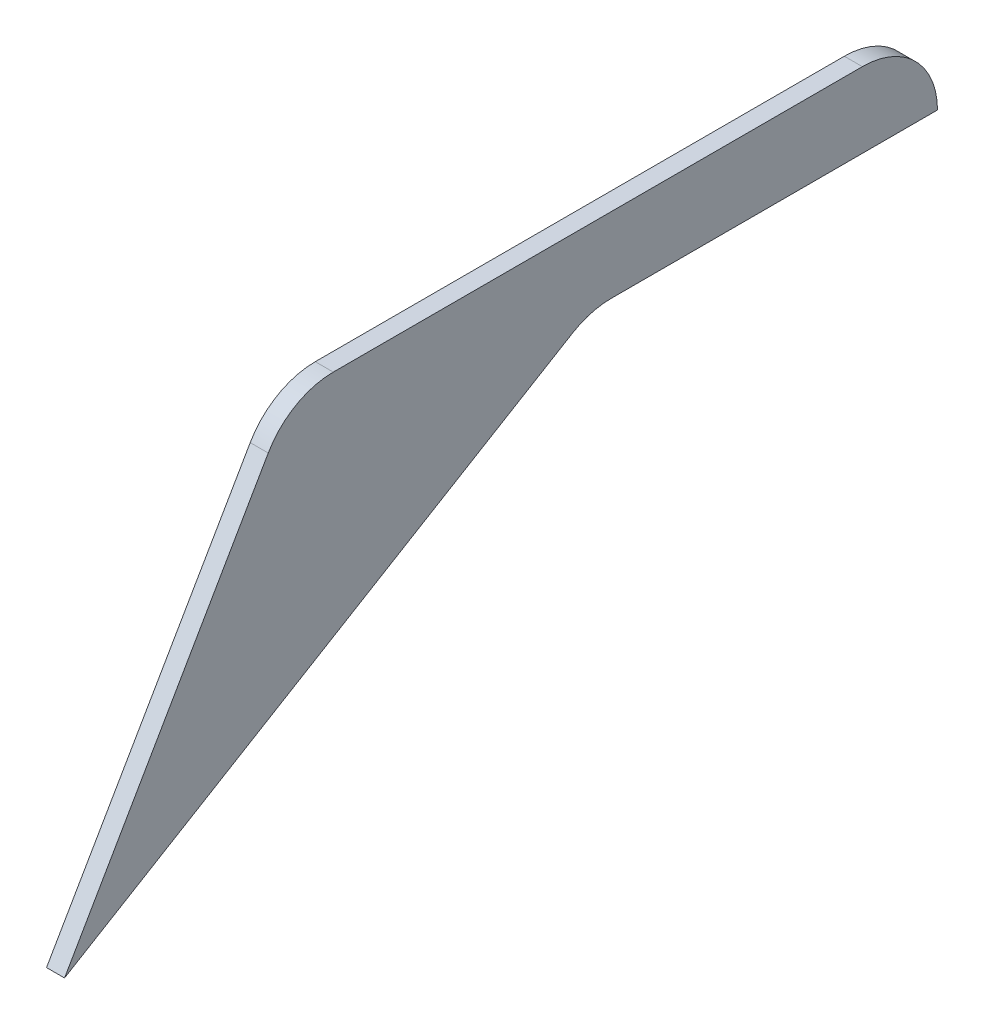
ISO-10303-21;
HEADER;
FILE_DESCRIPTION(('STEP AP214'),'2;1');
FILE_NAME('part.step','',(''),(''),'','','');
FILE_SCHEMA(('AUTOMOTIVE_DESIGN { 1 0 10303 214 1 1 1 1 }'));
ENDSEC;
DATA;
#1=APPLICATION_CONTEXT('core data for automotive mechanical design processes');
#2=APPLICATION_PROTOCOL_DEFINITION('international standard','automotive_design',2000,#1);
#3=PRODUCT_CONTEXT('',#1,'mechanical');
#4=PRODUCT('Part','Part','',(#3));
#5=PRODUCT_RELATED_PRODUCT_CATEGORY('part','',(#4));
#6=PRODUCT_DEFINITION_FORMATION('','',#4);
#7=PRODUCT_DEFINITION_CONTEXT('part definition',#1,'design');
#8=PRODUCT_DEFINITION('design','',#6,#7);
#9=PRODUCT_DEFINITION_SHAPE('','',#8);
#10=(LENGTH_UNIT() NAMED_UNIT(*) SI_UNIT(.MILLI.,.METRE.));
#11=(NAMED_UNIT(*) PLANE_ANGLE_UNIT() SI_UNIT($,.RADIAN.));
#12=(NAMED_UNIT(*) SI_UNIT($,.STERADIAN.) SOLID_ANGLE_UNIT());
#13=UNCERTAINTY_MEASURE_WITH_UNIT(LENGTH_MEASURE(1.E-05),#10,'distance_accuracy_value','');
#14=(GEOMETRIC_REPRESENTATION_CONTEXT(3) GLOBAL_UNCERTAINTY_ASSIGNED_CONTEXT((#13)) GLOBAL_UNIT_ASSIGNED_CONTEXT((#10,
#11,#12)) REPRESENTATION_CONTEXT('',''));
#15=CARTESIAN_POINT('',(0.,0.,0.));
#16=DIRECTION('',(0.,0.,1.));
#17=DIRECTION('',(1.,0.,0.));
#18=AXIS2_PLACEMENT_3D('',#15,#16,#17);
#19=CARTESIAN_POINT('',(343.116830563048,208.8847469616,-451.797499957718));
#20=DIRECTION('',(-1.,0.,0.));
#21=DIRECTION('',(0.,0.,1.));
#22=AXIS2_PLACEMENT_3D('',#19,#20,#21);
#23=CYLINDRICAL_SURFACE('',#22,12.7);
#24=CARTESIAN_POINT('',(340.068830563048,208.8847469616,-451.797499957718));
#25=DIRECTION('',(1.,0.,0.));
#26=DIRECTION('',(0.,0.,-1.));
#27=AXIS2_PLACEMENT_3D('',#24,#25,#26);
#28=CIRCLE('',#27,12.7);
#29=CARTESIAN_POINT('',(340.068830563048,208.8847469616,-464.497499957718));
#30=VERTEX_POINT('',#29);
#31=CARTESIAN_POINT('',(340.068830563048,221.5847469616,-451.797499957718));
#32=VERTEX_POINT('',#31);
#33=EDGE_CURVE('E117',#30,#32,#28,.T.);
#34=ORIENTED_EDGE('',*,*,#33,.T.);
#35=DIRECTION('',(-1.,0.,0.));
#36=VECTOR('',#35,1.);
#37=CARTESIAN_POINT('',(343.116830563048,221.5847469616,-451.797499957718));
#38=LINE('',#37,#36);
#39=CARTESIAN_POINT('',(343.116830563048,221.5847469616,-451.797499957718));
#40=VERTEX_POINT('',#39);
#41=EDGE_CURVE('E98',#40,#32,#38,.T.);
#42=ORIENTED_EDGE('',*,*,#41,.F.);
#43=CARTESIAN_POINT('',(343.116830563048,208.8847469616,-451.797499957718));
#44=DIRECTION('',(1.,0.,0.));
#45=DIRECTION('',(0.,0.,-1.));
#46=AXIS2_PLACEMENT_3D('',#43,#44,#45);
#47=CIRCLE('',#46,12.7);
#48=CARTESIAN_POINT('',(343.116830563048,208.8847469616,-464.497499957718));
#49=VERTEX_POINT('',#48);
#50=EDGE_CURVE('E105',#49,#40,#47,.T.);
#51=ORIENTED_EDGE('',*,*,#50,.F.);
#52=DIRECTION('',(-1.,0.,0.));
#53=VECTOR('',#52,1.);
#54=CARTESIAN_POINT('',(343.116830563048,208.8847469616,-464.497499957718));
#55=LINE('',#54,#53);
#56=EDGE_CURVE('E131',#49,#30,#55,.T.);
#57=ORIENTED_EDGE('',*,*,#56,.T.);
#58=EDGE_LOOP('',(#34,#42,#51,#57));
#59=FACE_BOUND('',#58,.T.);
#60=ADVANCED_FACE('F35',(#59),#23,.T.);
#61=CARTESIAN_POINT('',(343.116830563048,221.5847469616,-362.358153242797));
#62=DIRECTION('',(0.,-1.,0.));
#63=DIRECTION('',(0.,0.,-1.));
#64=AXIS2_PLACEMENT_3D('',#61,#62,#63);
#65=PLANE('',#64);
#66=DIRECTION('',(0.,0.,1.));
#67=VECTOR('',#66,1.);
#68=CARTESIAN_POINT('',(340.068830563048,221.5847469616,-362.358153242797));
#69=LINE('',#68,#67);
#70=CARTESIAN_POINT('',(340.068830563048,221.5847469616,-362.358153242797));
#71=VERTEX_POINT('',#70);
#72=EDGE_CURVE('E140',#32,#71,#69,.T.);
#73=ORIENTED_EDGE('',*,*,#72,.T.);
#74=DIRECTION('',(-1.,0.,0.));
#75=VECTOR('',#74,1.);
#76=CARTESIAN_POINT('',(343.116830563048,221.5847469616,-362.358153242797));
#77=LINE('',#76,#75);
#78=CARTESIAN_POINT('',(343.116830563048,221.5847469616,-362.358153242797));
#79=VERTEX_POINT('',#78);
#80=EDGE_CURVE('E101',#79,#71,#77,.T.);
#81=ORIENTED_EDGE('',*,*,#80,.F.);
#82=DIRECTION('',(0.,0.,1.));
#83=VECTOR('',#82,1.);
#84=CARTESIAN_POINT('',(343.116830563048,221.5847469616,-362.358153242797));
#85=LINE('',#84,#83);
#86=EDGE_CURVE('E94',#40,#79,#85,.T.);
#87=ORIENTED_EDGE('',*,*,#86,.F.);
#88=ORIENTED_EDGE('',*,*,#41,.T.);
#89=EDGE_LOOP('',(#73,#81,#87,#88));
#90=FACE_BOUND('',#89,.T.);
#91=ADVANCED_FACE('F96',(#90),#65,.F.);
#92=CARTESIAN_POINT('',(343.116830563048,208.8847469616,-362.358153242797));
#93=DIRECTION('',(-1.,0.,0.));
#94=DIRECTION('',(0.,0.,1.));
#95=AXIS2_PLACEMENT_3D('',#92,#93,#94);
#96=CYLINDRICAL_SURFACE('',#95,12.7000000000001);
#97=CARTESIAN_POINT('',(340.068830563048,208.8847469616,-362.358153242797));
#98=DIRECTION('',(1.,0.,0.));
#99=DIRECTION('',(0.,0.,-1.));
#100=AXIS2_PLACEMENT_3D('',#97,#98,#99);
#101=CIRCLE('',#100,12.7000000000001);
#102=CARTESIAN_POINT('',(340.068830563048,215.2347469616,-351.359630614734));
#103=VERTEX_POINT('',#102);
#104=EDGE_CURVE('E138',#71,#103,#101,.T.);
#105=ORIENTED_EDGE('',*,*,#104,.T.);
#106=DIRECTION('',(-1.,0.,0.));
#107=VECTOR('',#106,1.);
#108=CARTESIAN_POINT('',(343.116830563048,215.2347469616,-351.359630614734));
#109=LINE('',#108,#107);
#110=CARTESIAN_POINT('',(343.116830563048,215.2347469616,-351.359630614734));
#111=VERTEX_POINT('',#110);
#112=EDGE_CURVE('E122',#111,#103,#109,.T.);
#113=ORIENTED_EDGE('',*,*,#112,.F.);
#114=CARTESIAN_POINT('',(343.116830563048,208.8847469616,-362.358153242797));
#115=DIRECTION('',(1.,0.,0.));
#116=DIRECTION('',(0.,0.,-1.));
#117=AXIS2_PLACEMENT_3D('',#114,#115,#116);
#118=CIRCLE('',#117,12.7000000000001);
#119=EDGE_CURVE('E104',#79,#111,#118,.T.);
#120=ORIENTED_EDGE('',*,*,#119,.F.);
#121=ORIENTED_EDGE('',*,*,#80,.T.);
#122=EDGE_LOOP('',(#105,#113,#120,#121));
#123=FACE_BOUND('',#122,.T.);
#124=ADVANCED_FACE('F152',(#123),#96,.T.);
#125=CARTESIAN_POINT('',(343.116830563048,155.593611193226,-316.925804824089));
#126=DIRECTION('',(0.,-0.499999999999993,-0.866025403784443));
#127=DIRECTION('',(0.,0.866025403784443,-0.499999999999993));
#128=AXIS2_PLACEMENT_3D('',#125,#126,#127);
#129=PLANE('',#128);
#130=DIRECTION('',(0.,-0.866025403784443,0.499999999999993));
#131=VECTOR('',#130,1.);
#132=CARTESIAN_POINT('',(340.068830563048,155.593611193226,-316.925804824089));
#133=LINE('',#132,#131);
#134=CARTESIAN_POINT('',(340.068830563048,155.593611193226,-316.925804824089));
#135=VERTEX_POINT('',#134);
#136=EDGE_CURVE('E136',#103,#135,#133,.T.);
#137=ORIENTED_EDGE('',*,*,#136,.T.);
#138=DIRECTION('',(-1.,0.,0.));
#139=VECTOR('',#138,1.);
#140=CARTESIAN_POINT('',(343.116830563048,155.593611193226,-316.925804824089));
#141=LINE('',#140,#139);
#142=CARTESIAN_POINT('',(343.116830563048,155.593611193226,-316.925804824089));
#143=VERTEX_POINT('',#142);
#144=EDGE_CURVE('E128',#143,#135,#141,.T.);
#145=ORIENTED_EDGE('',*,*,#144,.F.);
#146=DIRECTION('',(0.,-0.866025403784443,0.499999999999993));
#147=VECTOR('',#146,1.);
#148=CARTESIAN_POINT('',(343.116830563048,155.593611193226,-316.925804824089));
#149=LINE('',#148,#147);
#150=EDGE_CURVE('E146',#111,#143,#149,.T.);
#151=ORIENTED_EDGE('',*,*,#150,.F.);
#152=ORIENTED_EDGE('',*,*,#112,.T.);
#153=EDGE_LOOP('',(#137,#145,#151,#152));
#154=FACE_BOUND('',#153,.T.);
#155=ADVANCED_FACE('F156',(#154),#129,.F.);
#156=CARTESIAN_POINT('',(343.116830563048,208.8847469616,-405.825804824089));
#157=DIRECTION('',(0.,0.857700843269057,0.51414906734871));
#158=DIRECTION('',(0.,-0.51414906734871,0.857700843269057));
#159=AXIS2_PLACEMENT_3D('',#156,#157,#158);
#160=PLANE('',#159);
#161=DIRECTION('',(0.,0.51414906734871,-0.857700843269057));
#162=VECTOR('',#161,1.);
#163=CARTESIAN_POINT('',(340.068830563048,208.8847469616,-405.825804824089));
#164=LINE('',#163,#162);
#165=CARTESIAN_POINT('',(340.068830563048,207.077547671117,-402.811044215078));
#166=VERTEX_POINT('',#165);
#167=EDGE_CURVE('E134',#135,#166,#164,.T.);
#168=ORIENTED_EDGE('',*,*,#167,.T.);
#169=DIRECTION('',(-1.,0.,0.));
#170=VECTOR('',#169,1.);
#171=CARTESIAN_POINT('',(343.116830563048,207.077547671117,-402.811044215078));
#172=LINE('',#171,#170);
#173=CARTESIAN_POINT('',(343.116830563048,207.077547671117,-402.811044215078));
#174=VERTEX_POINT('',#173);
#175=EDGE_CURVE('E50',#166,#174,#172,.F.);
#176=ORIENTED_EDGE('',*,*,#175,.T.);
#177=DIRECTION('',(0.,0.51414906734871,-0.857700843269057));
#178=VECTOR('',#177,1.);
#179=CARTESIAN_POINT('',(343.116830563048,208.8847469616,-405.825804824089));
#180=LINE('',#179,#178);
#181=EDGE_CURVE('E144',#143,#174,#180,.T.);
#182=ORIENTED_EDGE('',*,*,#181,.F.);
#183=ORIENTED_EDGE('',*,*,#144,.T.);
#184=EDGE_LOOP('',(#168,#176,#182,#183));
#185=FACE_BOUND('',#184,.T.);
#186=ADVANCED_FACE('F157',(#185),#160,.F.);
#187=CARTESIAN_POINT('',(343.116830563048,208.8847469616,-464.497499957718));
#188=DIRECTION('',(0.,1.,0.));
#189=DIRECTION('',(0.,0.,1.));
#190=AXIS2_PLACEMENT_3D('',#187,#188,#189);
#191=PLANE('',#190);
#192=DIRECTION('',(0.,0.,-1.));
#193=VECTOR('',#192,1.);
#194=CARTESIAN_POINT('',(343.116830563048,208.8847469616,-464.497499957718));
#195=LINE('',#194,#193);
#196=CARTESIAN_POINT('',(343.116830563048,208.8847469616,-409.340737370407));
#197=VERTEX_POINT('',#196);
#198=EDGE_CURVE('E110',#197,#49,#195,.T.);
#199=ORIENTED_EDGE('',*,*,#198,.F.);
#200=DIRECTION('',(-1.,0.,0.));
#201=VECTOR('',#200,1.);
#202=CARTESIAN_POINT('',(340.068830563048,208.8847469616,-409.340737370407));
#203=LINE('',#202,#201);
#204=CARTESIAN_POINT('',(340.068830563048,208.8847469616,-409.340737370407));
#205=VERTEX_POINT('',#204);
#206=EDGE_CURVE('E118',#197,#205,#203,.T.);
#207=ORIENTED_EDGE('',*,*,#206,.T.);
#208=DIRECTION('',(0.,0.,-1.));
#209=VECTOR('',#208,1.);
#210=CARTESIAN_POINT('',(340.068830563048,208.8847469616,-464.497499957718));
#211=LINE('',#210,#209);
#212=EDGE_CURVE('E114',#205,#30,#211,.T.);
#213=ORIENTED_EDGE('',*,*,#212,.T.);
#214=ORIENTED_EDGE('',*,*,#56,.F.);
#215=EDGE_LOOP('',(#199,#207,#213,#214));
#216=FACE_BOUND('',#215,.T.);
#217=ADVANCED_FACE('F162',(#216),#191,.F.);
#218=CARTESIAN_POINT('',(343.116830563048,208.8847469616,-451.797499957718));
#219=DIRECTION('',(1.,0.,0.));
#220=DIRECTION('',(0.,0.,-1.));
#221=AXIS2_PLACEMENT_3D('',#218,#219,#220);
#222=PLANE('',#221);
#223=ORIENTED_EDGE('',*,*,#50,.T.);
#224=ORIENTED_EDGE('',*,*,#86,.T.);
#225=ORIENTED_EDGE('',*,*,#119,.T.);
#226=ORIENTED_EDGE('',*,*,#150,.T.);
#227=ORIENTED_EDGE('',*,*,#181,.T.);
#228=CARTESIAN_POINT('',(343.116830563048,196.1847469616,-409.340737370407));
#229=DIRECTION('',(1.,0.,0.));
#230=DIRECTION('',(0.,0.,-1.));
#231=AXIS2_PLACEMENT_3D('',#228,#229,#230);
#232=CIRCLE('',#231,12.7);
#233=EDGE_CURVE('E11',#174,#197,#232,.F.);
#234=ORIENTED_EDGE('',*,*,#233,.T.);
#235=ORIENTED_EDGE('',*,*,#198,.T.);
#236=EDGE_LOOP('',(#223,#224,#225,#226,#227,#234,#235));
#237=FACE_BOUND('',#236,.T.);
#238=ADVANCED_FACE('F108',(#237),#222,.T.);
#239=CARTESIAN_POINT('',(340.068830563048,208.8847469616,-451.797499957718));
#240=DIRECTION('',(1.,0.,0.));
#241=DIRECTION('',(0.,0.,-1.));
#242=AXIS2_PLACEMENT_3D('',#239,#240,#241);
#243=PLANE('',#242);
#244=ORIENTED_EDGE('',*,*,#33,.F.);
#245=ORIENTED_EDGE('',*,*,#212,.F.);
#246=CARTESIAN_POINT('',(340.068830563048,196.1847469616,-409.340737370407));
#247=DIRECTION('',(1.,0.,0.));
#248=DIRECTION('',(0.,0.,-1.));
#249=AXIS2_PLACEMENT_3D('',#246,#247,#248);
#250=CIRCLE('',#249,12.7);
#251=EDGE_CURVE('E43',#205,#166,#250,.T.);
#252=ORIENTED_EDGE('',*,*,#251,.T.);
#253=ORIENTED_EDGE('',*,*,#167,.F.);
#254=ORIENTED_EDGE('',*,*,#136,.F.);
#255=ORIENTED_EDGE('',*,*,#104,.F.);
#256=ORIENTED_EDGE('',*,*,#72,.F.);
#257=EDGE_LOOP('',(#244,#245,#252,#253,#254,#255,#256));
#258=FACE_BOUND('',#257,.T.);
#259=ADVANCED_FACE('F163',(#258),#243,.F.);
#260=CARTESIAN_POINT('',(343.116830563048,196.1847469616,-409.340737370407));
#261=DIRECTION('',(1.,0.,0.));
#262=DIRECTION('',(0.,0.,-1.));
#263=AXIS2_PLACEMENT_3D('',#260,#261,#262);
#264=CYLINDRICAL_SURFACE('',#263,12.7);
#265=ORIENTED_EDGE('',*,*,#233,.F.);
#266=ORIENTED_EDGE('',*,*,#175,.F.);
#267=ORIENTED_EDGE('',*,*,#251,.F.);
#268=ORIENTED_EDGE('',*,*,#206,.F.);
#269=EDGE_LOOP('',(#265,#266,#267,#268));
#270=FACE_BOUND('',#269,.T.);
#271=ADVANCED_FACE('F37',(#270),#264,.F.);
#272=CLOSED_SHELL('',(#60,#91,#124,#155,#186,#217,#238,#259,#271));
#273=MANIFOLD_SOLID_BREP('B2',#272);
#274=ADVANCED_BREP_SHAPE_REPRESENTATION('',(#18,#273),#14);
#275=SHAPE_DEFINITION_REPRESENTATION(#9,#274);
ENDSEC;
END-ISO-10303-21;
